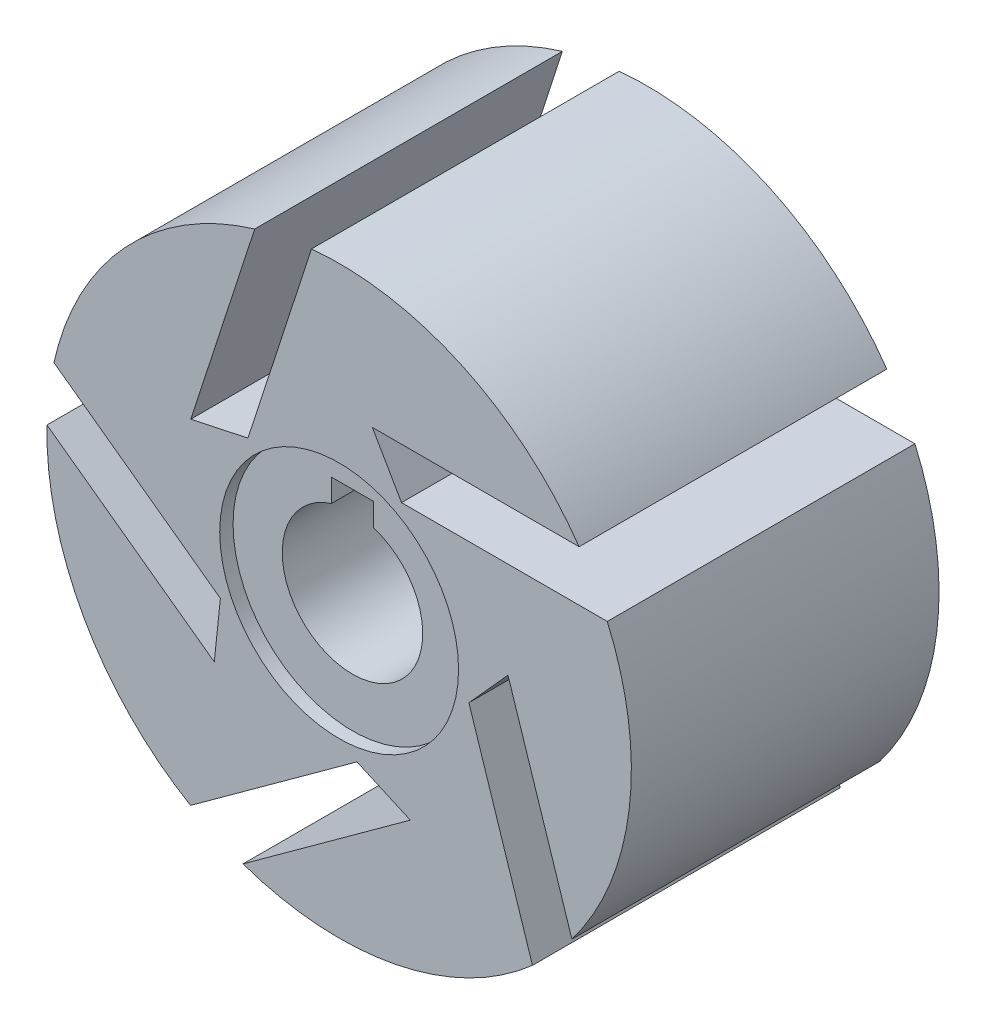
ISO-10303-21;
HEADER;
FILE_DESCRIPTION(('STEP AP214'),'2;1');
FILE_NAME('part.step','',(''),(''),'','','');
FILE_SCHEMA(('AUTOMOTIVE_DESIGN { 1 0 10303 214 1 1 1 1 }'));
ENDSEC;
DATA;
#1=APPLICATION_CONTEXT('core data for automotive mechanical design processes');
#2=APPLICATION_PROTOCOL_DEFINITION('international standard','automotive_design',2000,#1);
#3=PRODUCT_CONTEXT('',#1,'mechanical');
#4=PRODUCT('Part','Part','',(#3));
#5=PRODUCT_RELATED_PRODUCT_CATEGORY('part','',(#4));
#6=PRODUCT_DEFINITION_FORMATION('','',#4);
#7=PRODUCT_DEFINITION_CONTEXT('part definition',#1,'design');
#8=PRODUCT_DEFINITION('design','',#6,#7);
#9=PRODUCT_DEFINITION_SHAPE('','',#8);
#10=(LENGTH_UNIT() NAMED_UNIT(*) SI_UNIT(.MILLI.,.METRE.));
#11=(NAMED_UNIT(*) PLANE_ANGLE_UNIT() SI_UNIT($,.RADIAN.));
#12=(NAMED_UNIT(*) SI_UNIT($,.STERADIAN.) SOLID_ANGLE_UNIT());
#13=UNCERTAINTY_MEASURE_WITH_UNIT(LENGTH_MEASURE(1.E-05),#10,'distance_accuracy_value','');
#14=(GEOMETRIC_REPRESENTATION_CONTEXT(3) GLOBAL_UNCERTAINTY_ASSIGNED_CONTEXT((#13)) GLOBAL_UNIT_ASSIGNED_CONTEXT((#10,
#11,#12)) REPRESENTATION_CONTEXT('',''));
#15=CARTESIAN_POINT('',(0.,0.,0.));
#16=DIRECTION('',(0.,0.,1.));
#17=DIRECTION('',(1.,0.,0.));
#18=AXIS2_PLACEMENT_3D('',#15,#16,#17);
#19=CARTESIAN_POINT('',(0.,0.,21.9));
#20=DIRECTION('',(0.,0.,-1.));
#21=DIRECTION('',(-1.,0.,0.));
#22=AXIS2_PLACEMENT_3D('',#19,#20,#21);
#23=CYLINDRICAL_SURFACE('',#22,5.);
#24=CARTESIAN_POINT('',(0.,0.,20.95));
#25=DIRECTION('',(0.,0.,1.));
#26=DIRECTION('',(1.,0.,0.));
#27=AXIS2_PLACEMENT_3D('',#24,#25,#26);
#28=CIRCLE('',#27,5.);
#29=CARTESIAN_POINT('',(1.5,4.76969600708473,20.95));
#30=VERTEX_POINT('',#29);
#31=CARTESIAN_POINT('',(-1.5,4.76969600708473,20.95));
#32=VERTEX_POINT('',#31);
#33=EDGE_CURVE('E199',#30,#32,#28,.F.);
#34=ORIENTED_EDGE('',*,*,#33,.F.);
#35=DIRECTION('',(0.,0.,-1.));
#36=VECTOR('',#35,1.);
#37=CARTESIAN_POINT('',(1.5,4.76969600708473,21.9));
#38=LINE('',#37,#36);
#39=CARTESIAN_POINT('',(1.5,4.76969600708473,0.95));
#40=VERTEX_POINT('',#39);
#41=EDGE_CURVE('E198',#30,#40,#38,.T.);
#42=ORIENTED_EDGE('',*,*,#41,.T.);
#43=CARTESIAN_POINT('',(0.,0.,0.95));
#44=DIRECTION('',(0.,0.,-1.));
#45=DIRECTION('',(-1.,0.,0.));
#46=AXIS2_PLACEMENT_3D('',#43,#44,#45);
#47=CIRCLE('',#46,5.);
#48=CARTESIAN_POINT('',(-1.5,4.76969600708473,0.95));
#49=VERTEX_POINT('',#48);
#50=EDGE_CURVE('E210',#49,#40,#47,.F.);
#51=ORIENTED_EDGE('',*,*,#50,.F.);
#52=DIRECTION('',(0.,0.,-1.));
#53=VECTOR('',#52,1.);
#54=CARTESIAN_POINT('',(-1.5,4.76969600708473,21.9));
#55=LINE('',#54,#53);
#56=EDGE_CURVE('E346',#49,#32,#55,.F.);
#57=ORIENTED_EDGE('',*,*,#56,.T.);
#58=EDGE_LOOP('',(#34,#42,#51,#57));
#59=FACE_BOUND('',#58,.T.);
#60=ADVANCED_FACE('F32',(#59),#23,.F.);
#61=CARTESIAN_POINT('',(1.5,6.4,21.9));
#62=DIRECTION('',(1.,0.,0.));
#63=DIRECTION('',(0.,1.,0.));
#64=AXIS2_PLACEMENT_3D('',#61,#62,#63);
#65=PLANE('',#64);
#66=DIRECTION('',(0.,-1.,0.));
#67=VECTOR('',#66,1.);
#68=CARTESIAN_POINT('',(1.5,6.4,20.95));
#69=LINE('',#68,#67);
#70=CARTESIAN_POINT('',(1.5,6.4,20.95));
#71=VERTEX_POINT('',#70);
#72=EDGE_CURVE('E192',#71,#30,#69,.T.);
#73=ORIENTED_EDGE('',*,*,#72,.F.);
#74=DIRECTION('',(0.,0.,-1.));
#75=VECTOR('',#74,1.);
#76=CARTESIAN_POINT('',(1.5,6.4,21.9));
#77=LINE('',#76,#75);
#78=CARTESIAN_POINT('',(1.5,6.4,0.95));
#79=VERTEX_POINT('',#78);
#80=EDGE_CURVE('E54',#71,#79,#77,.T.);
#81=ORIENTED_EDGE('',*,*,#80,.T.);
#82=DIRECTION('',(0.,1.,0.));
#83=VECTOR('',#82,1.);
#84=CARTESIAN_POINT('',(1.5,6.4,0.95));
#85=LINE('',#84,#83);
#86=EDGE_CURVE('E361',#40,#79,#85,.T.);
#87=ORIENTED_EDGE('',*,*,#86,.F.);
#88=ORIENTED_EDGE('',*,*,#41,.F.);
#89=EDGE_LOOP('',(#73,#81,#87,#88));
#90=FACE_BOUND('',#89,.T.);
#91=ADVANCED_FACE('F197',(#90),#65,.F.);
#92=CARTESIAN_POINT('',(-1.5,6.4,21.9));
#93=DIRECTION('',(-1.,0.,0.));
#94=DIRECTION('',(0.,-1.,0.));
#95=AXIS2_PLACEMENT_3D('',#92,#93,#94);
#96=PLANE('',#95);
#97=DIRECTION('',(0.,1.,0.));
#98=VECTOR('',#97,1.);
#99=CARTESIAN_POINT('',(-1.5,6.4,20.95));
#100=LINE('',#99,#98);
#101=CARTESIAN_POINT('',(-1.5,6.4,20.95));
#102=VERTEX_POINT('',#101);
#103=EDGE_CURVE('E46',#32,#102,#100,.T.);
#104=ORIENTED_EDGE('',*,*,#103,.F.);
#105=ORIENTED_EDGE('',*,*,#56,.F.);
#106=DIRECTION('',(0.,-1.,0.));
#107=VECTOR('',#106,1.);
#108=CARTESIAN_POINT('',(-1.5,6.4,0.95));
#109=LINE('',#108,#107);
#110=CARTESIAN_POINT('',(-1.5,6.4,0.95));
#111=VERTEX_POINT('',#110);
#112=EDGE_CURVE('E359',#111,#49,#109,.T.);
#113=ORIENTED_EDGE('',*,*,#112,.F.);
#114=DIRECTION('',(0.,0.,-1.));
#115=VECTOR('',#114,1.);
#116=CARTESIAN_POINT('',(-1.5,6.4,21.9));
#117=LINE('',#116,#115);
#118=EDGE_CURVE('E205',#102,#111,#117,.T.);
#119=ORIENTED_EDGE('',*,*,#118,.F.);
#120=EDGE_LOOP('',(#104,#105,#113,#119));
#121=FACE_BOUND('',#120,.T.);
#122=ADVANCED_FACE('F364',(#121),#96,.F.);
#123=CARTESIAN_POINT('',(1.5,6.4,21.9));
#124=DIRECTION('',(0.,1.,0.));
#125=DIRECTION('',(0.,0.,1.));
#126=AXIS2_PLACEMENT_3D('',#123,#124,#125);
#127=PLANE('',#126);
#128=DIRECTION('',(1.,0.,0.));
#129=VECTOR('',#128,1.);
#130=CARTESIAN_POINT('',(1.5,6.4,20.95));
#131=LINE('',#130,#129);
#132=EDGE_CURVE('E11',#102,#71,#131,.T.);
#133=ORIENTED_EDGE('',*,*,#132,.F.);
#134=ORIENTED_EDGE('',*,*,#118,.T.);
#135=DIRECTION('',(-1.,0.,0.));
#136=VECTOR('',#135,1.);
#137=CARTESIAN_POINT('',(1.5,6.4,0.95));
#138=LINE('',#137,#136);
#139=EDGE_CURVE('E40',#79,#111,#138,.T.);
#140=ORIENTED_EDGE('',*,*,#139,.F.);
#141=ORIENTED_EDGE('',*,*,#80,.F.);
#142=EDGE_LOOP('',(#133,#134,#140,#141));
#143=FACE_BOUND('',#142,.T.);
#144=ADVANCED_FACE('F202',(#143),#127,.F.);
#145=CARTESIAN_POINT('',(0.,0.,21.9));
#146=DIRECTION('',(0.,0.,-1.));
#147=DIRECTION('',(-1.,0.,0.));
#148=AXIS2_PLACEMENT_3D('',#145,#146,#147);
#149=CYLINDRICAL_SURFACE('',#148,20.7999999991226);
#150=DIRECTION('',(0.,0.,-1.));
#151=VECTOR('',#150,1.);
#152=CARTESIAN_POINT('',(-6.00950312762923,19.9129573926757,21.9));
#153=LINE('',#152,#151);
#154=CARTESIAN_POINT('',(-6.00950312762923,19.9129573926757,21.9));
#155=VERTEX_POINT('',#154);
#156=CARTESIAN_POINT('',(-6.00950312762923,19.9129573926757,0.));
#157=VERTEX_POINT('',#156);
#158=EDGE_CURVE('E229',#155,#157,#153,.T.);
#159=ORIENTED_EDGE('',*,*,#158,.T.);
#160=CARTESIAN_POINT('',(0.,0.,0.));
#161=DIRECTION('',(0.,0.,-1.));
#162=DIRECTION('',(-1.,0.,0.));
#163=AXIS2_PLACEMENT_3D('',#160,#161,#162);
#164=CIRCLE('',#163,20.7999999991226);
#165=CARTESIAN_POINT('',(-20.301002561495,4.52871890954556,0.));
#166=VERTEX_POINT('',#165);
#167=EDGE_CURVE('E410',#166,#157,#164,.T.);
#168=ORIENTED_EDGE('',*,*,#167,.F.);
#169=DIRECTION('',(0.,0.,-1.));
#170=VECTOR('',#169,1.);
#171=CARTESIAN_POINT('',(-20.301002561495,4.52871890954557,21.9));
#172=LINE('',#171,#170);
#173=CARTESIAN_POINT('',(-20.301002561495,4.52871890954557,21.9));
#174=VERTEX_POINT('',#173);
#175=EDGE_CURVE('E248',#174,#166,#172,.T.);
#176=ORIENTED_EDGE('',*,*,#175,.F.);
#177=CARTESIAN_POINT('',(0.,0.,21.9));
#178=DIRECTION('',(0.,0.,-1.));
#179=DIRECTION('',(-1.,0.,0.));
#180=AXIS2_PLACEMENT_3D('',#177,#178,#179);
#181=CIRCLE('',#180,20.7999999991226);
#182=EDGE_CURVE('E411',#174,#155,#181,.T.);
#183=ORIENTED_EDGE('',*,*,#182,.T.);
#184=EDGE_LOOP('',(#159,#168,#176,#183));
#185=FACE_BOUND('',#184,.T.);
#186=ADVANCED_FACE('F408',(#185),#149,.T.);
#187=DIRECTION('',(0.,0.,-1.));
#188=VECTOR('',#187,1.);
#189=CARTESIAN_POINT('',(-20.7953864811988,0.438065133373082,21.9));
#190=LINE('',#189,#188);
#191=CARTESIAN_POINT('',(-20.7953864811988,0.438065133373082,21.9));
#192=VERTEX_POINT('',#191);
#193=CARTESIAN_POINT('',(-20.7953864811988,0.438065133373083,0.));
#194=VERTEX_POINT('',#193);
#195=EDGE_CURVE('E255',#192,#194,#190,.T.);
#196=ORIENTED_EDGE('',*,*,#195,.T.);
#197=CARTESIAN_POINT('',(-10.5804224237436,-17.9079496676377,0.));
#198=VERTEX_POINT('',#197);
#199=EDGE_CURVE('E415',#198,#194,#164,.T.);
#200=ORIENTED_EDGE('',*,*,#199,.F.);
#201=DIRECTION('',(0.,0.,-1.));
#202=VECTOR('',#201,1.);
#203=CARTESIAN_POINT('',(-10.5804224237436,-17.9079496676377,21.9));
#204=LINE('',#203,#202);
#205=CARTESIAN_POINT('',(-10.5804224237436,-17.9079496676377,21.9));
#206=VERTEX_POINT('',#205);
#207=EDGE_CURVE('E274',#206,#198,#204,.T.);
#208=ORIENTED_EDGE('',*,*,#207,.F.);
#209=EDGE_CURVE('E427',#206,#192,#181,.T.);
#210=ORIENTED_EDGE('',*,*,#209,.T.);
#211=EDGE_LOOP('',(#196,#200,#208,#210));
#212=FACE_BOUND('',#211,.T.);
#213=ADVANCED_FACE('F655',(#212),#149,.T.);
#214=DIRECTION('',(0.,0.,-1.));
#215=VECTOR('',#214,1.);
#216=CARTESIAN_POINT('',(-6.84275252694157,-19.6422182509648,21.9));
#217=LINE('',#216,#215);
#218=CARTESIAN_POINT('',(-6.84275252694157,-19.6422182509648,21.9));
#219=VERTEX_POINT('',#218);
#220=CARTESIAN_POINT('',(-6.84275252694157,-19.6422182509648,0.));
#221=VERTEX_POINT('',#220);
#222=EDGE_CURVE('E281',#219,#221,#217,.T.);
#223=ORIENTED_EDGE('',*,*,#222,.T.);
#224=CARTESIAN_POINT('',(13.7619418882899,-15.5964404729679,0.));
#225=VERTEX_POINT('',#224);
#226=EDGE_CURVE('E352',#225,#221,#164,.T.);
#227=ORIENTED_EDGE('',*,*,#226,.F.);
#228=DIRECTION('',(0.,0.,-1.));
#229=VECTOR('',#228,1.);
#230=CARTESIAN_POINT('',(13.7619418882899,-15.5964404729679,21.9));
#231=LINE('',#230,#229);
#232=CARTESIAN_POINT('',(13.7619418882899,-15.5964404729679,21.9));
#233=VERTEX_POINT('',#232);
#234=EDGE_CURVE('E300',#233,#225,#231,.T.);
#235=ORIENTED_EDGE('',*,*,#234,.F.);
#236=EDGE_CURVE('E347',#233,#219,#181,.T.);
#237=ORIENTED_EDGE('',*,*,#236,.T.);
#238=EDGE_LOOP('',(#223,#227,#235,#237));
#239=FACE_BOUND('',#238,.T.);
#240=ADVANCED_FACE('F436',(#239),#149,.T.);
#241=DIRECTION('',(0.,0.,-1.));
#242=VECTOR('',#241,1.);
#243=CARTESIAN_POINT('',(16.5663328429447,-12.5776236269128,21.9));
#244=LINE('',#243,#242);
#245=CARTESIAN_POINT('',(16.5663328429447,-12.5776236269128,21.9));
#246=VERTEX_POINT('',#245);
#247=CARTESIAN_POINT('',(16.5663328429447,-12.5776236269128,0.));
#248=VERTEX_POINT('',#247);
#249=EDGE_CURVE('E307',#246,#248,#244,.T.);
#250=ORIENTED_EDGE('',*,*,#249,.T.);
#251=CARTESIAN_POINT('',(19.0857702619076,8.2688193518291,0.));
#252=VERTEX_POINT('',#251);
#253=EDGE_CURVE('E349',#252,#248,#164,.T.);
#254=ORIENTED_EDGE('',*,*,#253,.F.);
#255=DIRECTION('',(0.,0.,-1.));
#256=VECTOR('',#255,1.);
#257=CARTESIAN_POINT('',(19.0857702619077,8.2688193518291,21.9));
#258=LINE('',#257,#256);
#259=CARTESIAN_POINT('',(19.0857702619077,8.2688193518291,21.9));
#260=VERTEX_POINT('',#259);
#261=EDGE_CURVE('E326',#260,#252,#258,.T.);
#262=ORIENTED_EDGE('',*,*,#261,.F.);
#263=EDGE_CURVE('E343',#260,#246,#181,.T.);
#264=ORIENTED_EDGE('',*,*,#263,.T.);
#265=EDGE_LOOP('',(#250,#254,#262,#264));
#266=FACE_BOUND('',#265,.T.);
#267=ADVANCED_FACE('F459',(#266),#149,.T.);
#268=DIRECTION('',(0.,0.,-1.));
#269=VECTOR('',#268,1.);
#270=CARTESIAN_POINT('',(-1.96628716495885,20.7068518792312,21.9));
#271=LINE('',#270,#269);
#272=CARTESIAN_POINT('',(-1.96628716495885,20.7068518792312,21.9));
#273=VERTEX_POINT('',#272);
#274=CARTESIAN_POINT('',(-1.96628716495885,20.7068518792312,0.));
#275=VERTEX_POINT('',#274);
#276=EDGE_CURVE('E224',#273,#275,#271,.T.);
#277=ORIENTED_EDGE('',*,*,#276,.F.);
#278=CARTESIAN_POINT('',(17.081309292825,11.8688193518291,21.9));
#279=VERTEX_POINT('',#278);
#280=EDGE_CURVE('E348',#273,#279,#181,.T.);
#281=ORIENTED_EDGE('',*,*,#280,.T.);
#282=DIRECTION('',(0.,0.,-1.));
#283=VECTOR('',#282,1.);
#284=CARTESIAN_POINT('',(17.081309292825,11.8688193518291,21.9));
#285=LINE('',#284,#283);
#286=CARTESIAN_POINT('',(17.081309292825,11.8688193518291,0.));
#287=VERTEX_POINT('',#286);
#288=EDGE_CURVE('E334',#279,#287,#285,.T.);
#289=ORIENTED_EDGE('',*,*,#288,.T.);
#290=EDGE_CURVE('E337',#275,#287,#164,.T.);
#291=ORIENTED_EDGE('',*,*,#290,.F.);
#292=EDGE_LOOP('',(#277,#281,#289,#291));
#293=FACE_BOUND('',#292,.T.);
#294=ADVANCED_FACE('F34',(#293),#149,.T.);
#295=CARTESIAN_POINT('',(0.,0.,21.9));
#296=DIRECTION('',(0.,0.,-1.));
#297=DIRECTION('',(-1.,0.,0.));
#298=AXIS2_PLACEMENT_3D('',#295,#296,#297);
#299=PLANE('',#298);
#300=CARTESIAN_POINT('',(0.,0.,21.9));
#301=DIRECTION('',(0.,0.,1.));
#302=DIRECTION('',(1.,0.,0.));
#303=AXIS2_PLACEMENT_3D('',#300,#301,#302);
#304=CIRCLE('',#303,8.5);
#305=CARTESIAN_POINT('',(8.5,0.,21.9));
#306=VERTEX_POINT('',#305);
#307=EDGE_CURVE('E376',#306,#306,#304,.T.);
#308=ORIENTED_EDGE('',*,*,#307,.F.);
#309=EDGE_LOOP('',(#308));
#310=FACE_BOUND('',#309,.T.);
#311=DIRECTION('',(-0.978147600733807,-0.207911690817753,0.));
#312=VECTOR('',#311,1.);
#313=CARTESIAN_POINT('',(-10.5579242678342,5.91435652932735,21.9));
#314=LINE('',#313,#312);
#315=CARTESIAN_POINT('',(-6.49184104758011,6.77862919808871,21.9));
#316=VERTEX_POINT('',#315);
#317=CARTESIAN_POINT('',(-10.5579242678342,5.91435652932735,21.9));
#318=VERTEX_POINT('',#317);
#319=EDGE_CURVE('E218',#316,#318,#314,.T.);
#320=ORIENTED_EDGE('',*,*,#319,.T.);
#321=DIRECTION('',(0.309016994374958,0.95105651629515,0.));
#322=VECTOR('',#321,1.);
#323=CARTESIAN_POINT('',(-6.00950312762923,19.9129573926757,21.9));
#324=LINE('',#323,#322);
#325=EDGE_CURVE('E222',#318,#155,#324,.T.);
#326=ORIENTED_EDGE('',*,*,#325,.T.);
#327=ORIENTED_EDGE('',*,*,#182,.F.);
#328=DIRECTION('',(0.809016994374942,-0.58778525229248,0.));
#329=VECTOR('',#328,1.);
#330=CARTESIAN_POINT('',(-8.45294867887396,-4.07939611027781,21.9));
#331=LINE('',#330,#329);
#332=CARTESIAN_POINT('',(-8.45294867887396,-4.07939611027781,21.9));
#333=VERTEX_POINT('',#332);
#334=EDGE_CURVE('E238',#174,#333,#331,.T.);
#335=ORIENTED_EDGE('',*,*,#334,.T.);
#336=DIRECTION('',(-0.104528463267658,-0.994521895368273,0.));
#337=VECTOR('',#336,1.);
#338=CARTESIAN_POINT('',(-8.887465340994,-8.21354599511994,21.9));
#339=LINE('',#338,#337);
#340=CARTESIAN_POINT('',(-8.887465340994,-8.21354599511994,21.9));
#341=VERTEX_POINT('',#340);
#342=EDGE_CURVE('E241',#333,#341,#339,.T.);
#343=ORIENTED_EDGE('',*,*,#342,.T.);
#344=DIRECTION('',(-0.809016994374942,0.58778525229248,0.));
#345=VECTOR('',#344,1.);
#346=CARTESIAN_POINT('',(-20.7953864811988,0.438065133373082,21.9));
#347=LINE('',#346,#345);
#348=EDGE_CURVE('E245',#341,#192,#347,.T.);
#349=ORIENTED_EDGE('',*,*,#348,.T.);
#350=ORIENTED_EDGE('',*,*,#209,.F.);
#351=DIRECTION('',(0.809016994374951,0.587785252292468,0.));
#352=VECTOR('',#351,1.);
#353=CARTESIAN_POINT('',(1.26763145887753,-9.29983464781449,21.9));
#354=LINE('',#353,#352);
#355=CARTESIAN_POINT('',(1.26763145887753,-9.29983464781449,21.9));
#356=VERTEX_POINT('',#355);
#357=EDGE_CURVE('E264',#206,#356,#354,.T.);
#358=ORIENTED_EDGE('',*,*,#357,.T.);
#359=DIRECTION('',(0.9135454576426,-0.406736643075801,0.));
#360=VECTOR('',#359,1.);
#361=CARTESIAN_POINT('',(5.06516861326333,-10.990607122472,21.9));
#362=LINE('',#361,#360);
#363=CARTESIAN_POINT('',(5.06516861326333,-10.990607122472,21.9));
#364=VERTEX_POINT('',#363);
#365=EDGE_CURVE('E267',#356,#364,#362,.T.);
#366=ORIENTED_EDGE('',*,*,#365,.T.);
#367=DIRECTION('',(-0.809016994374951,-0.587785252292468,0.));
#368=VECTOR('',#367,1.);
#369=CARTESIAN_POINT('',(-6.84275252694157,-19.6422182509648,21.9));
#370=LINE('',#369,#368);
#371=EDGE_CURVE('E271',#364,#219,#370,.T.);
#372=ORIENTED_EDGE('',*,*,#371,.T.);
#373=ORIENTED_EDGE('',*,*,#236,.F.);
#374=DIRECTION('',(-0.309016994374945,0.951056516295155,0.));
#375=VECTOR('',#374,1.);
#376=CARTESIAN_POINT('',(9.23638800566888,-1.6682177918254,21.9));
#377=LINE('',#376,#375);
#378=CARTESIAN_POINT('',(9.23638800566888,-1.6682177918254,21.9));
#379=VERTEX_POINT('',#378);
#380=EDGE_CURVE('E290',#233,#379,#377,.T.);
#381=ORIENTED_EDGE('',*,*,#380,.T.);
#382=DIRECTION('',(0.669130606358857,0.743144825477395,0.));
#383=VECTOR('',#382,1.);
#384=CARTESIAN_POINT('',(12.0179117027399,1.42097723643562,21.9));
#385=LINE('',#384,#383);
#386=CARTESIAN_POINT('',(12.0179117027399,1.42097723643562,21.9));
#387=VERTEX_POINT('',#386);
#388=EDGE_CURVE('E293',#379,#387,#385,.T.);
#389=ORIENTED_EDGE('',*,*,#388,.T.);
#390=DIRECTION('',(0.309016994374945,-0.951056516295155,0.));
#391=VECTOR('',#390,1.);
#392=CARTESIAN_POINT('',(16.5663328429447,-12.5776236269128,21.9));
#393=LINE('',#392,#391);
#394=EDGE_CURVE('E297',#387,#246,#393,.T.);
#395=ORIENTED_EDGE('',*,*,#394,.T.);
#396=ORIENTED_EDGE('',*,*,#263,.F.);
#397=DIRECTION('',(-1.,0.,0.));
#398=VECTOR('',#397,1.);
#399=CARTESIAN_POINT('',(4.44077026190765,8.2688193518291,21.9));
#400=LINE('',#399,#398);
#401=CARTESIAN_POINT('',(4.44077026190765,8.2688193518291,21.9));
#402=VERTEX_POINT('',#401);
#403=EDGE_CURVE('E316',#260,#402,#400,.T.);
#404=ORIENTED_EDGE('',*,*,#403,.T.);
#405=DIRECTION('',(-0.500000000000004,0.866025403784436,0.));
#406=VECTOR('',#405,1.);
#407=CARTESIAN_POINT('',(2.36230929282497,11.8688193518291,21.9));
#408=LINE('',#407,#406);
#409=CARTESIAN_POINT('',(2.36230929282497,11.8688193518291,21.9));
#410=VERTEX_POINT('',#409);
#411=EDGE_CURVE('E319',#402,#410,#408,.T.);
#412=ORIENTED_EDGE('',*,*,#411,.T.);
#413=DIRECTION('',(1.,0.,0.));
#414=VECTOR('',#413,1.);
#415=CARTESIAN_POINT('',(17.081309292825,11.8688193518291,21.9));
#416=LINE('',#415,#414);
#417=EDGE_CURVE('E323',#410,#279,#416,.T.);
#418=ORIENTED_EDGE('',*,*,#417,.T.);
#419=ORIENTED_EDGE('',*,*,#280,.F.);
#420=DIRECTION('',(-0.309016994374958,-0.95105651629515,0.));
#421=VECTOR('',#420,1.);
#422=CARTESIAN_POINT('',(-6.49184104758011,6.77862919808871,21.9));
#423=LINE('',#422,#421);
#424=EDGE_CURVE('E215',#273,#316,#423,.T.);
#425=ORIENTED_EDGE('',*,*,#424,.T.);
#426=EDGE_LOOP('',(#320,#326,#327,#335,#343,#349,#350,#358,#366,#372,#373,#381,#389,#395,#396,
#404,#412,#418,#419,#425));
#427=FACE_BOUND('',#426,.T.);
#428=ADVANCED_FACE('F389',(#310,#427),#299,.F.);
#429=CARTESIAN_POINT('',(0.,0.,0.));
#430=DIRECTION('',(0.,0.,-1.));
#431=DIRECTION('',(-1.,0.,0.));
#432=AXIS2_PLACEMENT_3D('',#429,#430,#431);
#433=PLANE('',#432);
#434=CARTESIAN_POINT('',(0.,0.,0.));
#435=DIRECTION('',(0.,0.,-1.));
#436=DIRECTION('',(-1.,0.,0.));
#437=AXIS2_PLACEMENT_3D('',#434,#435,#436);
#438=CIRCLE('',#437,8.5);
#439=CARTESIAN_POINT('',(-8.5,0.,0.));
#440=VERTEX_POINT('',#439);
#441=EDGE_CURVE('E368',#440,#440,#438,.T.);
#442=ORIENTED_EDGE('',*,*,#441,.F.);
#443=EDGE_LOOP('',(#442));
#444=FACE_BOUND('',#443,.T.);
#445=DIRECTION('',(0.309016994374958,0.95105651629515,0.));
#446=VECTOR('',#445,1.);
#447=CARTESIAN_POINT('',(-6.00950312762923,19.9129573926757,0.));
#448=LINE('',#447,#446);
#449=CARTESIAN_POINT('',(-10.5579242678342,5.91435652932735,0.));
#450=VERTEX_POINT('',#449);
#451=EDGE_CURVE('E219',#450,#157,#448,.T.);
#452=ORIENTED_EDGE('',*,*,#451,.F.);
#453=DIRECTION('',(-0.978147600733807,-0.207911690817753,0.));
#454=VECTOR('',#453,1.);
#455=CARTESIAN_POINT('',(-10.5579242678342,5.91435652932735,0.));
#456=LINE('',#455,#454);
#457=CARTESIAN_POINT('',(-6.49184104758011,6.77862919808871,0.));
#458=VERTEX_POINT('',#457);
#459=EDGE_CURVE('E208',#458,#450,#456,.T.);
#460=ORIENTED_EDGE('',*,*,#459,.F.);
#461=DIRECTION('',(-0.309016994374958,-0.95105651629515,0.));
#462=VECTOR('',#461,1.);
#463=CARTESIAN_POINT('',(-6.49184104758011,6.77862919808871,0.));
#464=LINE('',#463,#462);
#465=EDGE_CURVE('E204',#275,#458,#464,.T.);
#466=ORIENTED_EDGE('',*,*,#465,.F.);
#467=ORIENTED_EDGE('',*,*,#290,.T.);
#468=DIRECTION('',(1.,0.,0.));
#469=VECTOR('',#468,1.);
#470=CARTESIAN_POINT('',(17.081309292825,11.8688193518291,0.));
#471=LINE('',#470,#469);
#472=CARTESIAN_POINT('',(2.36230929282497,11.8688193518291,0.));
#473=VERTEX_POINT('',#472);
#474=EDGE_CURVE('E320',#473,#287,#471,.T.);
#475=ORIENTED_EDGE('',*,*,#474,.F.);
#476=DIRECTION('',(-0.500000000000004,0.866025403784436,0.));
#477=VECTOR('',#476,1.);
#478=CARTESIAN_POINT('',(2.36230929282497,11.8688193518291,0.));
#479=LINE('',#478,#477);
#480=CARTESIAN_POINT('',(4.44077026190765,8.2688193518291,0.));
#481=VERTEX_POINT('',#480);
#482=EDGE_CURVE('E329',#481,#473,#479,.T.);
#483=ORIENTED_EDGE('',*,*,#482,.F.);
#484=DIRECTION('',(-1.,0.,0.));
#485=VECTOR('',#484,1.);
#486=CARTESIAN_POINT('',(4.44077026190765,8.2688193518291,0.));
#487=LINE('',#486,#485);
#488=EDGE_CURVE('E310',#252,#481,#487,.T.);
#489=ORIENTED_EDGE('',*,*,#488,.F.);
#490=ORIENTED_EDGE('',*,*,#253,.T.);
#491=DIRECTION('',(0.309016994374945,-0.951056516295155,0.));
#492=VECTOR('',#491,1.);
#493=CARTESIAN_POINT('',(16.5663328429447,-12.5776236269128,0.));
#494=LINE('',#493,#492);
#495=CARTESIAN_POINT('',(12.0179117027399,1.42097723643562,0.));
#496=VERTEX_POINT('',#495);
#497=EDGE_CURVE('E294',#496,#248,#494,.T.);
#498=ORIENTED_EDGE('',*,*,#497,.F.);
#499=DIRECTION('',(0.669130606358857,0.743144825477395,0.));
#500=VECTOR('',#499,1.);
#501=CARTESIAN_POINT('',(12.0179117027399,1.42097723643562,0.));
#502=LINE('',#501,#500);
#503=CARTESIAN_POINT('',(9.23638800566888,-1.6682177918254,0.));
#504=VERTEX_POINT('',#503);
#505=EDGE_CURVE('E303',#504,#496,#502,.T.);
#506=ORIENTED_EDGE('',*,*,#505,.F.);
#507=DIRECTION('',(-0.309016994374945,0.951056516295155,0.));
#508=VECTOR('',#507,1.);
#509=CARTESIAN_POINT('',(9.23638800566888,-1.6682177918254,0.));
#510=LINE('',#509,#508);
#511=EDGE_CURVE('E284',#225,#504,#510,.T.);
#512=ORIENTED_EDGE('',*,*,#511,.F.);
#513=ORIENTED_EDGE('',*,*,#226,.T.);
#514=DIRECTION('',(-0.809016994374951,-0.587785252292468,0.));
#515=VECTOR('',#514,1.);
#516=CARTESIAN_POINT('',(-6.84275252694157,-19.6422182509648,0.));
#517=LINE('',#516,#515);
#518=CARTESIAN_POINT('',(5.06516861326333,-10.990607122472,0.));
#519=VERTEX_POINT('',#518);
#520=EDGE_CURVE('E268',#519,#221,#517,.T.);
#521=ORIENTED_EDGE('',*,*,#520,.F.);
#522=DIRECTION('',(0.9135454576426,-0.406736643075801,0.));
#523=VECTOR('',#522,1.);
#524=CARTESIAN_POINT('',(5.06516861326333,-10.990607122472,0.));
#525=LINE('',#524,#523);
#526=CARTESIAN_POINT('',(1.26763145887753,-9.29983464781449,0.));
#527=VERTEX_POINT('',#526);
#528=EDGE_CURVE('E277',#527,#519,#525,.T.);
#529=ORIENTED_EDGE('',*,*,#528,.F.);
#530=DIRECTION('',(0.809016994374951,0.587785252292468,0.));
#531=VECTOR('',#530,1.);
#532=CARTESIAN_POINT('',(1.26763145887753,-9.29983464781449,0.));
#533=LINE('',#532,#531);
#534=EDGE_CURVE('E258',#198,#527,#533,.T.);
#535=ORIENTED_EDGE('',*,*,#534,.F.);
#536=ORIENTED_EDGE('',*,*,#199,.T.);
#537=DIRECTION('',(-0.809016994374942,0.58778525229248,0.));
#538=VECTOR('',#537,1.);
#539=CARTESIAN_POINT('',(-20.7953864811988,0.438065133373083,0.));
#540=LINE('',#539,#538);
#541=CARTESIAN_POINT('',(-8.887465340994,-8.21354599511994,0.));
#542=VERTEX_POINT('',#541);
#543=EDGE_CURVE('E242',#542,#194,#540,.T.);
#544=ORIENTED_EDGE('',*,*,#543,.F.);
#545=DIRECTION('',(-0.104528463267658,-0.994521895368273,0.));
#546=VECTOR('',#545,1.);
#547=CARTESIAN_POINT('',(-8.887465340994,-8.21354599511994,0.));
#548=LINE('',#547,#546);
#549=CARTESIAN_POINT('',(-8.45294867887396,-4.07939611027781,0.));
#550=VERTEX_POINT('',#549);
#551=EDGE_CURVE('E251',#550,#542,#548,.T.);
#552=ORIENTED_EDGE('',*,*,#551,.F.);
#553=DIRECTION('',(0.809016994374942,-0.58778525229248,0.));
#554=VECTOR('',#553,1.);
#555=CARTESIAN_POINT('',(-8.45294867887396,-4.07939611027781,0.));
#556=LINE('',#555,#554);
#557=EDGE_CURVE('E232',#166,#550,#556,.T.);
#558=ORIENTED_EDGE('',*,*,#557,.F.);
#559=ORIENTED_EDGE('',*,*,#167,.T.);
#560=EDGE_LOOP('',(#452,#460,#466,#467,#475,#483,#489,#490,#498,#506,#512,#513,#521,#529,#535,
#536,#544,#552,#558,#559));
#561=FACE_BOUND('',#560,.T.);
#562=ADVANCED_FACE('F392',(#444,#561),#433,.T.);
#563=CARTESIAN_POINT('',(17.081309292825,11.8688193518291,21.9));
#564=DIRECTION('',(0.,1.,0.));
#565=DIRECTION('',(-1.,0.,0.));
#566=AXIS2_PLACEMENT_3D('',#563,#564,#565);
#567=PLANE('',#566);
#568=ORIENTED_EDGE('',*,*,#474,.T.);
#569=ORIENTED_EDGE('',*,*,#288,.F.);
#570=ORIENTED_EDGE('',*,*,#417,.F.);
#571=DIRECTION('',(0.,0.,-1.));
#572=VECTOR('',#571,1.);
#573=CARTESIAN_POINT('',(2.36230929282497,11.8688193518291,21.9));
#574=LINE('',#573,#572);
#575=EDGE_CURVE('E338',#410,#473,#574,.T.);
#576=ORIENTED_EDGE('',*,*,#575,.T.);
#577=EDGE_LOOP('',(#568,#569,#570,#576));
#578=FACE_BOUND('',#577,.T.);
#579=ADVANCED_FACE('F425',(#578),#567,.F.);
#580=CARTESIAN_POINT('',(2.36230929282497,11.8688193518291,21.9));
#581=DIRECTION('',(-0.866025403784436,-0.500000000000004,0.));
#582=DIRECTION('',(0.500000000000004,-0.866025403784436,0.));
#583=AXIS2_PLACEMENT_3D('',#580,#581,#582);
#584=PLANE('',#583);
#585=ORIENTED_EDGE('',*,*,#482,.T.);
#586=ORIENTED_EDGE('',*,*,#575,.F.);
#587=ORIENTED_EDGE('',*,*,#411,.F.);
#588=DIRECTION('',(0.,0.,-1.));
#589=VECTOR('',#588,1.);
#590=CARTESIAN_POINT('',(4.44077026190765,8.2688193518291,21.9));
#591=LINE('',#590,#589);
#592=EDGE_CURVE('E340',#402,#481,#591,.T.);
#593=ORIENTED_EDGE('',*,*,#592,.T.);
#594=EDGE_LOOP('',(#585,#586,#587,#593));
#595=FACE_BOUND('',#594,.T.);
#596=ADVANCED_FACE('F465',(#595),#584,.F.);
#597=CARTESIAN_POINT('',(4.44077026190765,8.2688193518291,21.9));
#598=DIRECTION('',(0.,-1.,0.));
#599=DIRECTION('',(1.,0.,0.));
#600=AXIS2_PLACEMENT_3D('',#597,#598,#599);
#601=PLANE('',#600);
#602=ORIENTED_EDGE('',*,*,#488,.T.);
#603=ORIENTED_EDGE('',*,*,#592,.F.);
#604=ORIENTED_EDGE('',*,*,#403,.F.);
#605=ORIENTED_EDGE('',*,*,#261,.T.);
#606=EDGE_LOOP('',(#602,#603,#604,#605));
#607=FACE_BOUND('',#606,.T.);
#608=ADVANCED_FACE('F463',(#607),#601,.F.);
#609=CARTESIAN_POINT('',(16.5663328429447,-12.5776236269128,21.9));
#610=DIRECTION('',(0.951056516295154,0.309016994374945,0.));
#611=DIRECTION('',(-0.309016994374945,0.951056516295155,0.));
#612=AXIS2_PLACEMENT_3D('',#609,#610,#611);
#613=PLANE('',#612);
#614=ORIENTED_EDGE('',*,*,#497,.T.);
#615=ORIENTED_EDGE('',*,*,#249,.F.);
#616=ORIENTED_EDGE('',*,*,#394,.F.);
#617=DIRECTION('',(0.,0.,-1.));
#618=VECTOR('',#617,1.);
#619=CARTESIAN_POINT('',(12.0179117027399,1.42097723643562,21.9));
#620=LINE('',#619,#618);
#621=EDGE_CURVE('E311',#387,#496,#620,.T.);
#622=ORIENTED_EDGE('',*,*,#621,.T.);
#623=EDGE_LOOP('',(#614,#615,#616,#622));
#624=FACE_BOUND('',#623,.T.);
#625=ADVANCED_FACE('F473',(#624),#613,.F.);
#626=CARTESIAN_POINT('',(12.0179117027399,1.42097723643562,21.9));
#627=DIRECTION('',(-0.743144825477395,0.669130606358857,0.));
#628=DIRECTION('',(-0.669130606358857,-0.743144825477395,0.));
#629=AXIS2_PLACEMENT_3D('',#626,#627,#628);
#630=PLANE('',#629);
#631=ORIENTED_EDGE('',*,*,#505,.T.);
#632=ORIENTED_EDGE('',*,*,#621,.F.);
#633=ORIENTED_EDGE('',*,*,#388,.F.);
#634=DIRECTION('',(0.,0.,-1.));
#635=VECTOR('',#634,1.);
#636=CARTESIAN_POINT('',(9.23638800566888,-1.6682177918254,21.9));
#637=LINE('',#636,#635);
#638=EDGE_CURVE('E313',#379,#504,#637,.T.);
#639=ORIENTED_EDGE('',*,*,#638,.T.);
#640=EDGE_LOOP('',(#631,#632,#633,#639));
#641=FACE_BOUND('',#640,.T.);
#642=ADVANCED_FACE('F453',(#641),#630,.F.);
#643=CARTESIAN_POINT('',(9.23638800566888,-1.6682177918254,21.9));
#644=DIRECTION('',(-0.951056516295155,-0.309016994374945,0.));
#645=DIRECTION('',(0.309016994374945,-0.951056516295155,0.));
#646=AXIS2_PLACEMENT_3D('',#643,#644,#645);
#647=PLANE('',#646);
#648=ORIENTED_EDGE('',*,*,#511,.T.);
#649=ORIENTED_EDGE('',*,*,#638,.F.);
#650=ORIENTED_EDGE('',*,*,#380,.F.);
#651=ORIENTED_EDGE('',*,*,#234,.T.);
#652=EDGE_LOOP('',(#648,#649,#650,#651));
#653=FACE_BOUND('',#652,.T.);
#654=ADVANCED_FACE('F450',(#653),#647,.F.);
#655=CARTESIAN_POINT('',(-6.84275252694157,-19.6422182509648,21.9));
#656=DIRECTION('',(0.587785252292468,-0.809016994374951,0.));
#657=DIRECTION('',(0.809016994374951,0.587785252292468,0.));
#658=AXIS2_PLACEMENT_3D('',#655,#656,#657);
#659=PLANE('',#658);
#660=ORIENTED_EDGE('',*,*,#520,.T.);
#661=ORIENTED_EDGE('',*,*,#222,.F.);
#662=ORIENTED_EDGE('',*,*,#371,.F.);
#663=DIRECTION('',(0.,0.,-1.));
#664=VECTOR('',#663,1.);
#665=CARTESIAN_POINT('',(5.06516861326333,-10.990607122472,21.9));
#666=LINE('',#665,#664);
#667=EDGE_CURVE('E285',#364,#519,#666,.T.);
#668=ORIENTED_EDGE('',*,*,#667,.T.);
#669=EDGE_LOOP('',(#660,#661,#662,#668));
#670=FACE_BOUND('',#669,.T.);
#671=ADVANCED_FACE('F442',(#670),#659,.F.);
#672=CARTESIAN_POINT('',(5.06516861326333,-10.990607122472,21.9));
#673=DIRECTION('',(0.406736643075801,0.9135454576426,0.));
#674=DIRECTION('',(-0.9135454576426,0.406736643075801,0.));
#675=AXIS2_PLACEMENT_3D('',#672,#673,#674);
#676=PLANE('',#675);
#677=ORIENTED_EDGE('',*,*,#528,.T.);
#678=ORIENTED_EDGE('',*,*,#667,.F.);
#679=ORIENTED_EDGE('',*,*,#365,.F.);
#680=DIRECTION('',(0.,0.,-1.));
#681=VECTOR('',#680,1.);
#682=CARTESIAN_POINT('',(1.26763145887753,-9.29983464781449,21.9));
#683=LINE('',#682,#681);
#684=EDGE_CURVE('E287',#356,#527,#683,.T.);
#685=ORIENTED_EDGE('',*,*,#684,.T.);
#686=EDGE_LOOP('',(#677,#678,#679,#685));
#687=FACE_BOUND('',#686,.T.);
#688=ADVANCED_FACE('F508',(#687),#676,.F.);
#689=CARTESIAN_POINT('',(1.26763145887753,-9.29983464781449,21.9));
#690=DIRECTION('',(-0.587785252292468,0.809016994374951,0.));
#691=DIRECTION('',(-0.809016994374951,-0.587785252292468,0.));
#692=AXIS2_PLACEMENT_3D('',#689,#690,#691);
#693=PLANE('',#692);
#694=ORIENTED_EDGE('',*,*,#534,.T.);
#695=ORIENTED_EDGE('',*,*,#684,.F.);
#696=ORIENTED_EDGE('',*,*,#357,.F.);
#697=ORIENTED_EDGE('',*,*,#207,.T.);
#698=EDGE_LOOP('',(#694,#695,#696,#697));
#699=FACE_BOUND('',#698,.T.);
#700=ADVANCED_FACE('F498',(#699),#693,.F.);
#701=CARTESIAN_POINT('',(-20.7953864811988,0.438065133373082,21.9));
#702=DIRECTION('',(-0.58778525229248,-0.809016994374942,0.));
#703=DIRECTION('',(0.809016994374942,-0.58778525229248,0.));
#704=AXIS2_PLACEMENT_3D('',#701,#702,#703);
#705=PLANE('',#704);
#706=ORIENTED_EDGE('',*,*,#543,.T.);
#707=ORIENTED_EDGE('',*,*,#195,.F.);
#708=ORIENTED_EDGE('',*,*,#348,.F.);
#709=DIRECTION('',(0.,0.,-1.));
#710=VECTOR('',#709,1.);
#711=CARTESIAN_POINT('',(-8.887465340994,-8.21354599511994,21.9));
#712=LINE('',#711,#710);
#713=EDGE_CURVE('E259',#341,#542,#712,.T.);
#714=ORIENTED_EDGE('',*,*,#713,.T.);
#715=EDGE_LOOP('',(#706,#707,#708,#714));
#716=FACE_BOUND('',#715,.T.);
#717=ADVANCED_FACE('F494',(#716),#705,.F.);
#718=CARTESIAN_POINT('',(-8.887465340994,-8.21354599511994,21.9));
#719=DIRECTION('',(0.994521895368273,-0.104528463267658,0.));
#720=DIRECTION('',(0.104528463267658,0.994521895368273,0.));
#721=AXIS2_PLACEMENT_3D('',#718,#719,#720);
#722=PLANE('',#721);
#723=ORIENTED_EDGE('',*,*,#551,.T.);
#724=ORIENTED_EDGE('',*,*,#713,.F.);
#725=ORIENTED_EDGE('',*,*,#342,.F.);
#726=DIRECTION('',(0.,0.,-1.));
#727=VECTOR('',#726,1.);
#728=CARTESIAN_POINT('',(-8.45294867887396,-4.07939611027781,21.9));
#729=LINE('',#728,#727);
#730=EDGE_CURVE('E261',#333,#550,#729,.T.);
#731=ORIENTED_EDGE('',*,*,#730,.T.);
#732=EDGE_LOOP('',(#723,#724,#725,#731));
#733=FACE_BOUND('',#732,.T.);
#734=ADVANCED_FACE('F497',(#733),#722,.F.);
#735=CARTESIAN_POINT('',(-8.45294867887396,-4.07939611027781,21.9));
#736=DIRECTION('',(0.58778525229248,0.809016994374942,0.));
#737=DIRECTION('',(-0.809016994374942,0.58778525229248,0.));
#738=AXIS2_PLACEMENT_3D('',#735,#736,#737);
#739=PLANE('',#738);
#740=ORIENTED_EDGE('',*,*,#557,.T.);
#741=ORIENTED_EDGE('',*,*,#730,.F.);
#742=ORIENTED_EDGE('',*,*,#334,.F.);
#743=ORIENTED_EDGE('',*,*,#175,.T.);
#744=EDGE_LOOP('',(#740,#741,#742,#743));
#745=FACE_BOUND('',#744,.T.);
#746=ADVANCED_FACE('F487',(#745),#739,.F.);
#747=CARTESIAN_POINT('',(-6.00950312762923,19.9129573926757,21.9));
#748=DIRECTION('',(-0.95105651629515,0.309016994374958,0.));
#749=DIRECTION('',(-0.309016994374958,-0.95105651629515,0.));
#750=AXIS2_PLACEMENT_3D('',#747,#748,#749);
#751=PLANE('',#750);
#752=ORIENTED_EDGE('',*,*,#451,.T.);
#753=ORIENTED_EDGE('',*,*,#158,.F.);
#754=ORIENTED_EDGE('',*,*,#325,.F.);
#755=DIRECTION('',(0.,0.,-1.));
#756=VECTOR('',#755,1.);
#757=CARTESIAN_POINT('',(-10.5579242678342,5.91435652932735,21.9));
#758=LINE('',#757,#756);
#759=EDGE_CURVE('E233',#318,#450,#758,.T.);
#760=ORIENTED_EDGE('',*,*,#759,.T.);
#761=EDGE_LOOP('',(#752,#753,#754,#760));
#762=FACE_BOUND('',#761,.T.);
#763=ADVANCED_FACE('F404',(#762),#751,.F.);
#764=CARTESIAN_POINT('',(-10.5579242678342,5.91435652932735,21.9));
#765=DIRECTION('',(0.207911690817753,-0.978147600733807,0.));
#766=DIRECTION('',(0.978147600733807,0.207911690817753,0.));
#767=AXIS2_PLACEMENT_3D('',#764,#765,#766);
#768=PLANE('',#767);
#769=ORIENTED_EDGE('',*,*,#459,.T.);
#770=ORIENTED_EDGE('',*,*,#759,.F.);
#771=ORIENTED_EDGE('',*,*,#319,.F.);
#772=DIRECTION('',(0.,0.,-1.));
#773=VECTOR('',#772,1.);
#774=CARTESIAN_POINT('',(-6.49184104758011,6.77862919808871,21.9));
#775=LINE('',#774,#773);
#776=EDGE_CURVE('E235',#316,#458,#775,.T.);
#777=ORIENTED_EDGE('',*,*,#776,.T.);
#778=EDGE_LOOP('',(#769,#770,#771,#777));
#779=FACE_BOUND('',#778,.T.);
#780=ADVANCED_FACE('F400',(#779),#768,.F.);
#781=CARTESIAN_POINT('',(-6.49184104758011,6.77862919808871,21.9));
#782=DIRECTION('',(0.95105651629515,-0.309016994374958,0.));
#783=DIRECTION('',(0.309016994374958,0.95105651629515,0.));
#784=AXIS2_PLACEMENT_3D('',#781,#782,#783);
#785=PLANE('',#784);
#786=ORIENTED_EDGE('',*,*,#465,.T.);
#787=ORIENTED_EDGE('',*,*,#776,.F.);
#788=ORIENTED_EDGE('',*,*,#424,.F.);
#789=ORIENTED_EDGE('',*,*,#276,.T.);
#790=EDGE_LOOP('',(#786,#787,#788,#789));
#791=FACE_BOUND('',#790,.T.);
#792=ADVANCED_FACE('F490',(#791),#785,.F.);
#793=CARTESIAN_POINT('',(0.,0.,0.95));
#794=DIRECTION('',(0.,0.,-1.));
#795=DIRECTION('',(-1.,0.,0.));
#796=AXIS2_PLACEMENT_3D('',#793,#794,#795);
#797=PLANE('',#796);
#798=CARTESIAN_POINT('',(0.,0.,0.95));
#799=DIRECTION('',(0.,0.,-1.));
#800=DIRECTION('',(-1.,0.,0.));
#801=AXIS2_PLACEMENT_3D('',#798,#799,#800);
#802=CIRCLE('',#801,8.5);
#803=CARTESIAN_POINT('',(-8.5,0.,0.95));
#804=VERTEX_POINT('',#803);
#805=EDGE_CURVE('E365',#804,#804,#802,.T.);
#806=ORIENTED_EDGE('',*,*,#805,.T.);
#807=EDGE_LOOP('',(#806));
#808=FACE_BOUND('',#807,.T.);
#809=ORIENTED_EDGE('',*,*,#50,.T.);
#810=ORIENTED_EDGE('',*,*,#86,.T.);
#811=ORIENTED_EDGE('',*,*,#139,.T.);
#812=ORIENTED_EDGE('',*,*,#112,.T.);
#813=EDGE_LOOP('',(#809,#810,#811,#812));
#814=FACE_BOUND('',#813,.T.);
#815=ADVANCED_FACE('F358',(#808,#814),#797,.T.);
#816=CARTESIAN_POINT('',(0.,0.,0.95));
#817=DIRECTION('',(0.,0.,-1.));
#818=DIRECTION('',(-1.,0.,0.));
#819=AXIS2_PLACEMENT_3D('',#816,#817,#818);
#820=CYLINDRICAL_SURFACE('',#819,8.5);
#821=CARTESIAN_POINT('',(-8.5,0.,0.95));
#822=CARTESIAN_POINT('',(-8.5,0.,0.940104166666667));
#823=CARTESIAN_POINT('',(-8.5,0.,0.930208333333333));
#824=CARTESIAN_POINT('',(-8.5,0.,0.910416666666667));
#825=CARTESIAN_POINT('',(-8.5,0.,0.900520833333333));
#826=CARTESIAN_POINT('',(-8.5,0.,0.880729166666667));
#827=CARTESIAN_POINT('',(-8.5,0.,0.870833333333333));
#828=CARTESIAN_POINT('',(-8.5,0.,0.851041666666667));
#829=CARTESIAN_POINT('',(-8.5,0.,0.841145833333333));
#830=CARTESIAN_POINT('',(-8.5,0.,0.821354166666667));
#831=CARTESIAN_POINT('',(-8.5,0.,0.811458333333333));
#832=CARTESIAN_POINT('',(-8.5,0.,0.791666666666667));
#833=CARTESIAN_POINT('',(-8.5,0.,0.781770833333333));
#834=CARTESIAN_POINT('',(-8.5,0.,0.761979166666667));
#835=CARTESIAN_POINT('',(-8.5,0.,0.752083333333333));
#836=CARTESIAN_POINT('',(-8.5,0.,0.732291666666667));
#837=CARTESIAN_POINT('',(-8.5,0.,0.722395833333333));
#838=CARTESIAN_POINT('',(-8.5,0.,0.702604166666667));
#839=CARTESIAN_POINT('',(-8.5,0.,0.692708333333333));
#840=CARTESIAN_POINT('',(-8.5,0.,0.672916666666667));
#841=CARTESIAN_POINT('',(-8.5,0.,0.663020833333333));
#842=CARTESIAN_POINT('',(-8.5,0.,0.643229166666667));
#843=CARTESIAN_POINT('',(-8.5,0.,0.633333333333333));
#844=CARTESIAN_POINT('',(-8.5,0.,0.613541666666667));
#845=CARTESIAN_POINT('',(-8.5,0.,0.603645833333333));
#846=CARTESIAN_POINT('',(-8.5,0.,0.583854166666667));
#847=CARTESIAN_POINT('',(-8.5,0.,0.573958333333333));
#848=CARTESIAN_POINT('',(-8.5,0.,0.554166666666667));
#849=CARTESIAN_POINT('',(-8.5,0.,0.544270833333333));
#850=CARTESIAN_POINT('',(-8.5,0.,0.524479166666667));
#851=CARTESIAN_POINT('',(-8.5,0.,0.514583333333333));
#852=CARTESIAN_POINT('',(-8.5,0.,0.494791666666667));
#853=CARTESIAN_POINT('',(-8.5,0.,0.484895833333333));
#854=CARTESIAN_POINT('',(-8.5,0.,0.465104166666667));
#855=CARTESIAN_POINT('',(-8.5,0.,0.455208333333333));
#856=CARTESIAN_POINT('',(-8.5,0.,0.435416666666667));
#857=CARTESIAN_POINT('',(-8.5,0.,0.425520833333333));
#858=CARTESIAN_POINT('',(-8.5,0.,0.405729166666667));
#859=CARTESIAN_POINT('',(-8.5,0.,0.395833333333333));
#860=CARTESIAN_POINT('',(-8.5,0.,0.376041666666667));
#861=CARTESIAN_POINT('',(-8.5,0.,0.366145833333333));
#862=CARTESIAN_POINT('',(-8.5,0.,0.346354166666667));
#863=CARTESIAN_POINT('',(-8.5,0.,0.336458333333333));
#864=CARTESIAN_POINT('',(-8.5,0.,0.316666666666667));
#865=CARTESIAN_POINT('',(-8.5,0.,0.306770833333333));
#866=CARTESIAN_POINT('',(-8.5,0.,0.286979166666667));
#867=CARTESIAN_POINT('',(-8.5,0.,0.277083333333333));
#868=CARTESIAN_POINT('',(-8.5,0.,0.257291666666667));
#869=CARTESIAN_POINT('',(-8.5,0.,0.247395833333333));
#870=CARTESIAN_POINT('',(-8.5,0.,0.227604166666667));
#871=CARTESIAN_POINT('',(-8.5,0.,0.217708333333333));
#872=CARTESIAN_POINT('',(-8.5,0.,0.197916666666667));
#873=CARTESIAN_POINT('',(-8.5,0.,0.188020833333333));
#874=CARTESIAN_POINT('',(-8.5,0.,0.168229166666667));
#875=CARTESIAN_POINT('',(-8.5,0.,0.158333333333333));
#876=CARTESIAN_POINT('',(-8.5,0.,0.138541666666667));
#877=CARTESIAN_POINT('',(-8.5,0.,0.128645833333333));
#878=CARTESIAN_POINT('',(-8.5,0.,0.108854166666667));
#879=CARTESIAN_POINT('',(-8.5,0.,0.0989583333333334));
#880=CARTESIAN_POINT('',(-8.5,0.,0.0791666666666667));
#881=CARTESIAN_POINT('',(-8.5,0.,0.0692708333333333));
#882=CARTESIAN_POINT('',(-8.5,0.,0.0494791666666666));
#883=CARTESIAN_POINT('',(-8.5,0.,0.0395833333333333));
#884=CARTESIAN_POINT('',(-8.5,0.,0.0197916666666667));
#885=CARTESIAN_POINT('',(-8.5,0.,0.00989583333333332));
#886=CARTESIAN_POINT('',(-8.5,0.,0.));
#887=B_SPLINE_CURVE_WITH_KNOTS('',3,(#821,#822,#823,#824,#825,#826,#827,#828,#829,#830,#831,
#832,#833,#834,#835,#836,#837,#838,#839,#840,#841,#842,#843,#844,#845,#846,#847,#848,#849,#850,
#851,#852,#853,#854,#855,#856,#857,#858,#859,#860,#861,#862,#863,#864,#865,#866,#867,#868,#869,
#870,#871,#872,#873,#874,#875,#876,#877,#878,#879,#880,#881,#882,#883,#884,#885,#886),
.UNSPECIFIED.,.F.,.F.,(4,2,2,2,2,2,2,2,2,2,2,2,2,2,2,2,2,2,2,2,2,2,2,2,2,2,2,2,2,2,2,2,4),(0.,
0.0296875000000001,0.0593750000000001,0.0890625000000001,0.11875,0.1484375,0.178125,0.2078125,
0.2375,0.2671875,0.296875,0.3265625,0.35625,0.3859375,0.415625,0.4453125,0.475,0.5046875,
0.534375,0.5640625,0.59375,0.6234375,0.653125,0.6828125,0.7125,0.7421875,0.771875,0.8015625,
0.83125,0.8609375,0.890625,0.9203125,0.95),.UNSPECIFIED.);
#888=EDGE_CURVE('BSEAM567',#804,#440,#887,.T.);
#889=ORIENTED_EDGE('',*,*,#805,.F.);
#890=ORIENTED_EDGE('',*,*,#441,.T.);
#891=ORIENTED_EDGE('',*,*,#888,.T.);
#892=ORIENTED_EDGE('',*,*,#888,.F.);
#893=EDGE_LOOP('',(#889,#891,#890,#892));
#894=FACE_BOUND('',#893,.T.);
#895=ADVANCED_FACE('F567',(#894),#820,.F.);
#896=CARTESIAN_POINT('',(0.,0.,20.95));
#897=DIRECTION('',(0.,0.,1.));
#898=DIRECTION('',(1.,0.,0.));
#899=AXIS2_PLACEMENT_3D('',#896,#897,#898);
#900=PLANE('',#899);
#901=CARTESIAN_POINT('',(0.,0.,20.95));
#902=DIRECTION('',(0.,0.,1.));
#903=DIRECTION('',(1.,0.,0.));
#904=AXIS2_PLACEMENT_3D('',#901,#902,#903);
#905=CIRCLE('',#904,8.5);
#906=CARTESIAN_POINT('',(8.5,0.,20.95));
#907=VERTEX_POINT('',#906);
#908=EDGE_CURVE('E375',#907,#907,#905,.T.);
#909=ORIENTED_EDGE('',*,*,#908,.T.);
#910=EDGE_LOOP('',(#909));
#911=FACE_BOUND('',#910,.T.);
#912=ORIENTED_EDGE('',*,*,#33,.T.);
#913=ORIENTED_EDGE('',*,*,#103,.T.);
#914=ORIENTED_EDGE('',*,*,#132,.T.);
#915=ORIENTED_EDGE('',*,*,#72,.T.);
#916=EDGE_LOOP('',(#912,#913,#914,#915));
#917=FACE_BOUND('',#916,.T.);
#918=ADVANCED_FACE('F191',(#911,#917),#900,.T.);
#919=CARTESIAN_POINT('',(0.,0.,20.95));
#920=DIRECTION('',(0.,0.,1.));
#921=DIRECTION('',(1.,0.,0.));
#922=AXIS2_PLACEMENT_3D('',#919,#920,#921);
#923=CYLINDRICAL_SURFACE('',#922,8.5);
#924=CARTESIAN_POINT('',(8.5,0.,20.95));
#925=CARTESIAN_POINT('',(8.5,0.,20.9598958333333));
#926=CARTESIAN_POINT('',(8.5,0.,20.9697916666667));
#927=CARTESIAN_POINT('',(8.5,0.,20.9895833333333));
#928=CARTESIAN_POINT('',(8.5,0.,20.9994791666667));
#929=CARTESIAN_POINT('',(8.5,0.,21.0192708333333));
#930=CARTESIAN_POINT('',(8.5,0.,21.0291666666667));
#931=CARTESIAN_POINT('',(8.5,0.,21.0489583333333));
#932=CARTESIAN_POINT('',(8.5,0.,21.0588541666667));
#933=CARTESIAN_POINT('',(8.5,0.,21.0786458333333));
#934=CARTESIAN_POINT('',(8.5,0.,21.0885416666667));
#935=CARTESIAN_POINT('',(8.5,0.,21.1083333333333));
#936=CARTESIAN_POINT('',(8.5,0.,21.1182291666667));
#937=CARTESIAN_POINT('',(8.5,0.,21.1380208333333));
#938=CARTESIAN_POINT('',(8.5,0.,21.1479166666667));
#939=CARTESIAN_POINT('',(8.5,0.,21.1677083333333));
#940=CARTESIAN_POINT('',(8.5,0.,21.1776041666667));
#941=CARTESIAN_POINT('',(8.5,0.,21.1973958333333));
#942=CARTESIAN_POINT('',(8.5,0.,21.2072916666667));
#943=CARTESIAN_POINT('',(8.5,0.,21.2270833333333));
#944=CARTESIAN_POINT('',(8.5,0.,21.2369791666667));
#945=CARTESIAN_POINT('',(8.5,0.,21.2567708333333));
#946=CARTESIAN_POINT('',(8.5,0.,21.2666666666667));
#947=CARTESIAN_POINT('',(8.5,0.,21.2864583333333));
#948=CARTESIAN_POINT('',(8.5,0.,21.2963541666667));
#949=CARTESIAN_POINT('',(8.5,0.,21.3161458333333));
#950=CARTESIAN_POINT('',(8.5,0.,21.3260416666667));
#951=CARTESIAN_POINT('',(8.5,0.,21.3458333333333));
#952=CARTESIAN_POINT('',(8.5,0.,21.3557291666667));
#953=CARTESIAN_POINT('',(8.5,0.,21.3755208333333));
#954=CARTESIAN_POINT('',(8.5,0.,21.3854166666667));
#955=CARTESIAN_POINT('',(8.5,0.,21.4052083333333));
#956=CARTESIAN_POINT('',(8.5,0.,21.4151041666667));
#957=CARTESIAN_POINT('',(8.5,0.,21.4348958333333));
#958=CARTESIAN_POINT('',(8.5,0.,21.4447916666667));
#959=CARTESIAN_POINT('',(8.5,0.,21.4645833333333));
#960=CARTESIAN_POINT('',(8.5,0.,21.4744791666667));
#961=CARTESIAN_POINT('',(8.5,0.,21.4942708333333));
#962=CARTESIAN_POINT('',(8.5,0.,21.5041666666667));
#963=CARTESIAN_POINT('',(8.5,0.,21.5239583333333));
#964=CARTESIAN_POINT('',(8.5,0.,21.5338541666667));
#965=CARTESIAN_POINT('',(8.5,0.,21.5536458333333));
#966=CARTESIAN_POINT('',(8.5,0.,21.5635416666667));
#967=CARTESIAN_POINT('',(8.5,0.,21.5833333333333));
#968=CARTESIAN_POINT('',(8.5,0.,21.5932291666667));
#969=CARTESIAN_POINT('',(8.5,0.,21.6130208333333));
#970=CARTESIAN_POINT('',(8.5,0.,21.6229166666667));
#971=CARTESIAN_POINT('',(8.5,0.,21.6427083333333));
#972=CARTESIAN_POINT('',(8.5,0.,21.6526041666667));
#973=CARTESIAN_POINT('',(8.5,0.,21.6723958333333));
#974=CARTESIAN_POINT('',(8.5,0.,21.6822916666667));
#975=CARTESIAN_POINT('',(8.5,0.,21.7020833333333));
#976=CARTESIAN_POINT('',(8.5,0.,21.7119791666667));
#977=CARTESIAN_POINT('',(8.5,0.,21.7317708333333));
#978=CARTESIAN_POINT('',(8.5,0.,21.7416666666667));
#979=CARTESIAN_POINT('',(8.5,0.,21.7614583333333));
#980=CARTESIAN_POINT('',(8.5,0.,21.7713541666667));
#981=CARTESIAN_POINT('',(8.5,0.,21.7911458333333));
#982=CARTESIAN_POINT('',(8.5,0.,21.8010416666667));
#983=CARTESIAN_POINT('',(8.5,0.,21.8208333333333));
#984=CARTESIAN_POINT('',(8.5,0.,21.8307291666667));
#985=CARTESIAN_POINT('',(8.5,0.,21.8505208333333));
#986=CARTESIAN_POINT('',(8.5,0.,21.8604166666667));
#987=CARTESIAN_POINT('',(8.5,0.,21.8802083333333));
#988=CARTESIAN_POINT('',(8.5,0.,21.8901041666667));
#989=CARTESIAN_POINT('',(8.5,0.,21.9));
#990=B_SPLINE_CURVE_WITH_KNOTS('',3,(#924,#925,#926,#927,#928,#929,#930,#931,#932,#933,#934,
#935,#936,#937,#938,#939,#940,#941,#942,#943,#944,#945,#946,#947,#948,#949,#950,#951,#952,#953,
#954,#955,#956,#957,#958,#959,#960,#961,#962,#963,#964,#965,#966,#967,#968,#969,#970,#971,#972,
#973,#974,#975,#976,#977,#978,#979,#980,#981,#982,#983,#984,#985,#986,#987,#988,#989),
.UNSPECIFIED.,.F.,.F.,(4,2,2,2,2,2,2,2,2,2,2,2,2,2,2,2,2,2,2,2,2,2,2,2,2,2,2,2,2,2,2,2,4),(0.,
0.0296874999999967,0.0593749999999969,0.0890624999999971,0.118749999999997,0.148437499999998,
0.178124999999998,0.207812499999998,0.237499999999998,0.267187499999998,0.296874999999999,
0.326562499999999,0.356249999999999,0.385937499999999,0.415624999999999,0.4453125,0.475,
0.504687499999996,0.534374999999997,0.564062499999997,0.593749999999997,0.623437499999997,
0.653124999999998,0.682812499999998,0.712499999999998,0.742187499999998,0.771874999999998,
0.801562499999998,0.831249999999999,0.860937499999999,0.890624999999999,0.920312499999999,0.95),.UNSPECIFIED.);
#991=EDGE_CURVE('BSEAM383',#907,#306,#990,.T.);
#992=ORIENTED_EDGE('',*,*,#908,.F.);
#993=ORIENTED_EDGE('',*,*,#307,.T.);
#994=ORIENTED_EDGE('',*,*,#991,.T.);
#995=ORIENTED_EDGE('',*,*,#991,.F.);
#996=EDGE_LOOP('',(#992,#994,#993,#995));
#997=FACE_BOUND('',#996,.T.);
#998=ADVANCED_FACE('F383',(#997),#923,.F.);
#999=CLOSED_SHELL('',(#60,#91,#122,#144,#186,#213,#240,#267,#294,#428,#562,#579,#596,#608,#625,
#642,#654,#671,#688,#700,#717,#734,#746,#763,#780,#792,#815,#895,#918,#998));
#1000=MANIFOLD_SOLID_BREP('B2',#999);
#1001=ADVANCED_BREP_SHAPE_REPRESENTATION('',(#18,#1000),#14);
#1002=SHAPE_DEFINITION_REPRESENTATION(#9,#1001);
ENDSEC;
END-ISO-10303-21;
